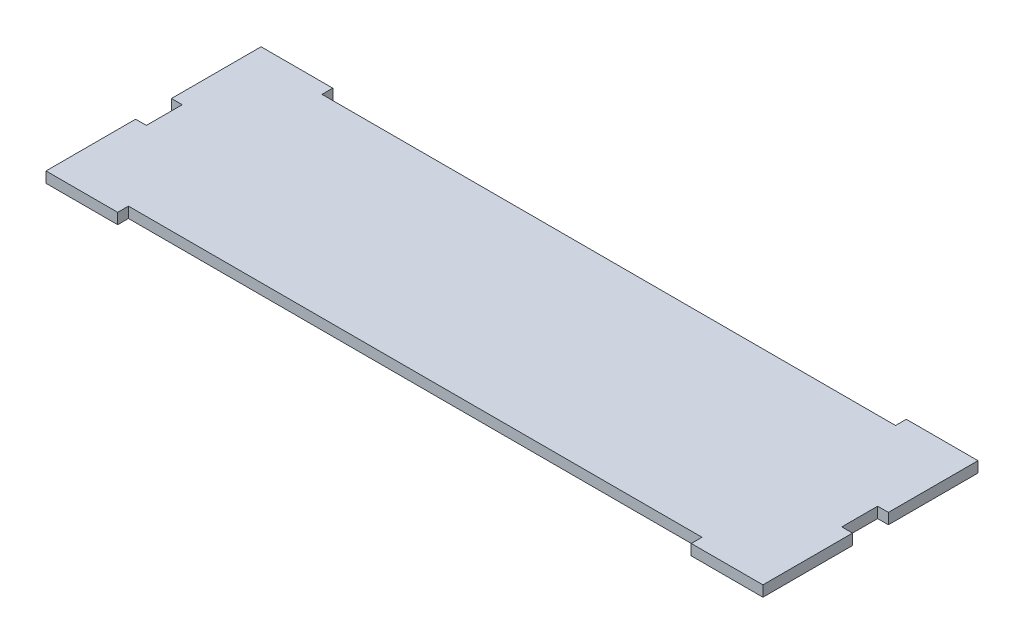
from build123d import *

# Parameters (mm, degrees)
BOSS_EXTRUDE1_DEPTH = 3


with BuildPart() as part:
    # Sketch1 → Boss-Extrude1 (new body)
    with BuildSketch(Plane(origin=(0, 0, 0), x_dir=(1, 0, 0), z_dir=(0, 1, 0))):
        Polygon((49.655878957, -88.681167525), (49.655878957, -113.681167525), (46.655878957, -113.681167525), (46.655878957, -123.681167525), (49.655878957, -123.681167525), (49.655878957, -148.681167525), (29.655878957, -148.681167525), (29.655878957, -145.681167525), (-130.344121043, -145.681167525), (-130.344121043, -148.681167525), (-150.344121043, -148.681167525), (-150.344121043, -123.681167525), (-147.344121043, -123.681167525), (-147.344121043, -113.681167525), (-150.344121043, -113.681167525), (-150.344121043, -88.681167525), (-130.344121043, -88.681167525), (-130.344121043, -91.681167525), (29.655878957, -91.681167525), (29.655878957, -88.681167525), align=None)
    extrude(amount=BOSS_EXTRUDE1_DEPTH)


solid = part.part
